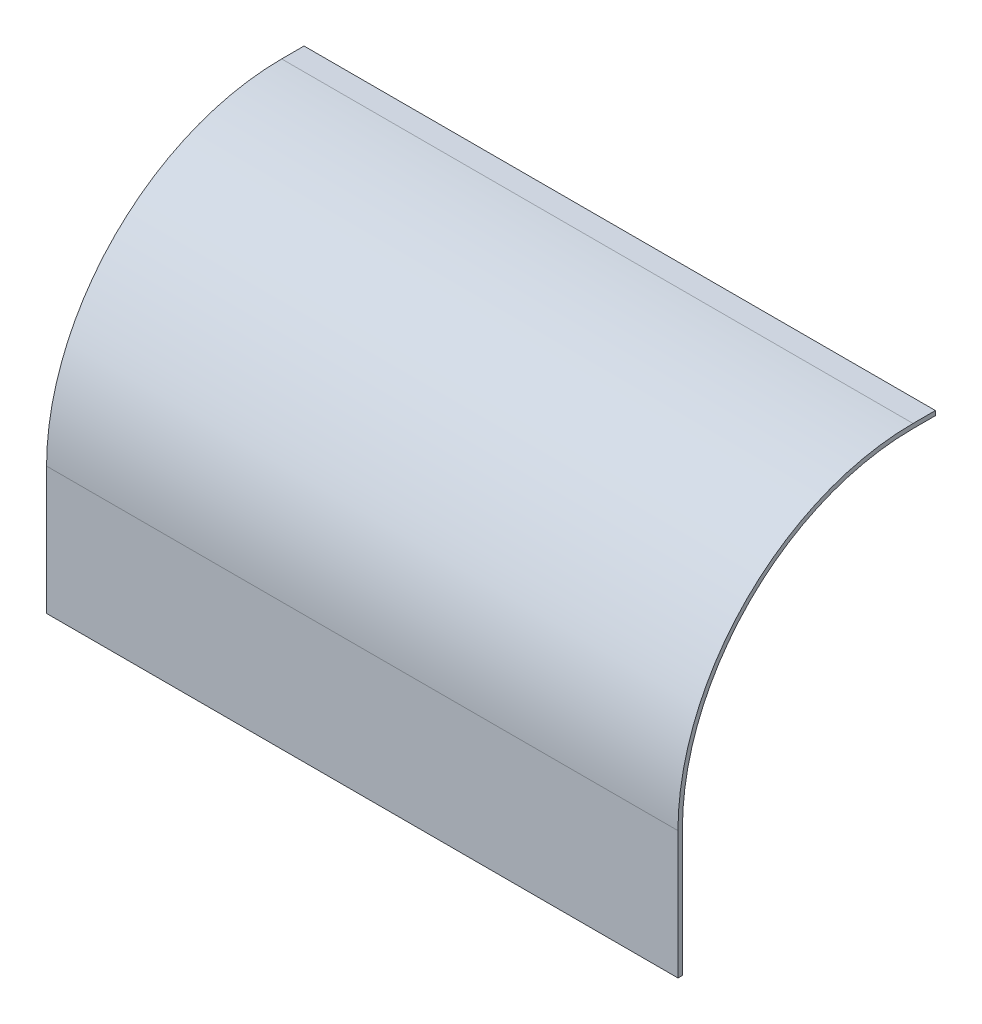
ISO-10303-21;
HEADER;
FILE_DESCRIPTION(('STEP AP214'),'2;1');
FILE_NAME('part.step','',(''),(''),'','','');
FILE_SCHEMA(('AUTOMOTIVE_DESIGN { 1 0 10303 214 1 1 1 1 }'));
ENDSEC;
DATA;
#1=APPLICATION_CONTEXT('core data for automotive mechanical design processes');
#2=APPLICATION_PROTOCOL_DEFINITION('international standard','automotive_design',2000,#1);
#3=PRODUCT_CONTEXT('',#1,'mechanical');
#4=PRODUCT('Part','Part','',(#3));
#5=PRODUCT_RELATED_PRODUCT_CATEGORY('part','',(#4));
#6=PRODUCT_DEFINITION_FORMATION('','',#4);
#7=PRODUCT_DEFINITION_CONTEXT('part definition',#1,'design');
#8=PRODUCT_DEFINITION('design','',#6,#7);
#9=PRODUCT_DEFINITION_SHAPE('','',#8);
#10=(LENGTH_UNIT() NAMED_UNIT(*) SI_UNIT(.MILLI.,.METRE.));
#11=(NAMED_UNIT(*) PLANE_ANGLE_UNIT() SI_UNIT($,.RADIAN.));
#12=(NAMED_UNIT(*) SI_UNIT($,.STERADIAN.) SOLID_ANGLE_UNIT());
#13=UNCERTAINTY_MEASURE_WITH_UNIT(LENGTH_MEASURE(1.E-05),#10,'distance_accuracy_value','');
#14=(GEOMETRIC_REPRESENTATION_CONTEXT(3) GLOBAL_UNCERTAINTY_ASSIGNED_CONTEXT((#13)) GLOBAL_UNIT_ASSIGNED_CONTEXT((#10,
#11,#12)) REPRESENTATION_CONTEXT('',''));
#15=CARTESIAN_POINT('',(0.,0.,0.));
#16=DIRECTION('',(0.,0.,1.));
#17=DIRECTION('',(1.,0.,0.));
#18=AXIS2_PLACEMENT_3D('',#15,#16,#17);
#19=CARTESIAN_POINT('',(-438.668064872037,112.,-5.00000000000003));
#20=DIRECTION('',(1.,0.,0.));
#21=DIRECTION('',(0.,0.,-1.));
#22=AXIS2_PLACEMENT_3D('',#19,#20,#21);
#23=CYLINDRICAL_SURFACE('',#22,105.);
#24=DIRECTION('',(1.,0.,0.));
#25=VECTOR('',#24,1.);
#26=CARTESIAN_POINT('',(-438.668064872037,217.,-5.00000000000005));
#27=LINE('',#26,#25);
#28=CARTESIAN_POINT('',(-231.,217.,-5.00000000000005));
#29=VERTEX_POINT('',#28);
#30=CARTESIAN_POINT('',(51.,217.,-5.00000000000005));
#31=VERTEX_POINT('',#30);
#32=EDGE_CURVE('E114',#29,#31,#27,.T.);
#33=ORIENTED_EDGE('',*,*,#32,.F.);
#34=CARTESIAN_POINT('',(-231.,112.,-5.00000000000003));
#35=DIRECTION('',(1.,0.,0.));
#36=DIRECTION('',(0.,0.,-1.));
#37=AXIS2_PLACEMENT_3D('',#34,#35,#36);
#38=CIRCLE('',#37,105.);
#39=CARTESIAN_POINT('',(-231.,112.,100.));
#40=VERTEX_POINT('',#39);
#41=EDGE_CURVE('E37',#29,#40,#38,.T.);
#42=ORIENTED_EDGE('',*,*,#41,.T.);
#43=DIRECTION('',(1.,0.,0.));
#44=VECTOR('',#43,1.);
#45=CARTESIAN_POINT('',(-438.668064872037,112.,100.));
#46=LINE('',#45,#44);
#47=CARTESIAN_POINT('',(51.,112.,100.));
#48=VERTEX_POINT('',#47);
#49=EDGE_CURVE('E148',#40,#48,#46,.T.);
#50=ORIENTED_EDGE('',*,*,#49,.T.);
#51=CARTESIAN_POINT('',(51.,112.,-5.00000000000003));
#52=DIRECTION('',(1.,0.,0.));
#53=DIRECTION('',(0.,0.,-1.));
#54=AXIS2_PLACEMENT_3D('',#51,#52,#53);
#55=CIRCLE('',#54,105.);
#56=EDGE_CURVE('E131',#48,#31,#55,.F.);
#57=ORIENTED_EDGE('',*,*,#56,.T.);
#58=EDGE_LOOP('',(#33,#42,#50,#57));
#59=FACE_BOUND('',#58,.T.);
#60=ADVANCED_FACE('F33',(#59),#23,.T.);
#61=CARTESIAN_POINT('',(-438.668064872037,55.,100.));
#62=DIRECTION('',(0.,0.,-1.));
#63=DIRECTION('',(-1.,0.,0.));
#64=AXIS2_PLACEMENT_3D('',#61,#62,#63);
#65=PLANE('',#64);
#66=ORIENTED_EDGE('',*,*,#49,.F.);
#67=DIRECTION('',(0.,-1.,0.));
#68=VECTOR('',#67,1.);
#69=CARTESIAN_POINT('',(-231.,55.,100.));
#70=LINE('',#69,#68);
#71=CARTESIAN_POINT('',(-231.,55.,100.));
#72=VERTEX_POINT('',#71);
#73=EDGE_CURVE('E136',#40,#72,#70,.T.);
#74=ORIENTED_EDGE('',*,*,#73,.T.);
#75=DIRECTION('',(1.,0.,0.));
#76=VECTOR('',#75,1.);
#77=CARTESIAN_POINT('',(-438.668064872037,55.,100.));
#78=LINE('',#77,#76);
#79=CARTESIAN_POINT('',(51.,55.,100.));
#80=VERTEX_POINT('',#79);
#81=EDGE_CURVE('E150',#72,#80,#78,.T.);
#82=ORIENTED_EDGE('',*,*,#81,.T.);
#83=DIRECTION('',(0.,1.,0.));
#84=VECTOR('',#83,1.);
#85=CARTESIAN_POINT('',(51.,55.,100.));
#86=LINE('',#85,#84);
#87=EDGE_CURVE('E128',#80,#48,#86,.T.);
#88=ORIENTED_EDGE('',*,*,#87,.T.);
#89=EDGE_LOOP('',(#66,#74,#82,#88));
#90=FACE_BOUND('',#89,.T.);
#91=ADVANCED_FACE('F166',(#90),#65,.F.);
#92=CARTESIAN_POINT('',(-438.668064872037,55.,100.));
#93=DIRECTION('',(0.,-1.,0.));
#94=DIRECTION('',(0.,0.,-1.));
#95=AXIS2_PLACEMENT_3D('',#92,#93,#94);
#96=PLANE('',#95);
#97=DIRECTION('',(0.,0.,1.));
#98=VECTOR('',#97,1.);
#99=CARTESIAN_POINT('',(-231.,55.,100.));
#100=LINE('',#99,#98);
#101=CARTESIAN_POINT('',(-231.,55.,98.));
#102=VERTEX_POINT('',#101);
#103=EDGE_CURVE('E139',#102,#72,#100,.T.);
#104=ORIENTED_EDGE('',*,*,#103,.F.);
#105=DIRECTION('',(1.,0.,0.));
#106=VECTOR('',#105,1.);
#107=CARTESIAN_POINT('',(-438.668064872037,55.,98.));
#108=LINE('',#107,#106);
#109=CARTESIAN_POINT('',(51.,55.,98.));
#110=VERTEX_POINT('',#109);
#111=EDGE_CURVE('E152',#102,#110,#108,.T.);
#112=ORIENTED_EDGE('',*,*,#111,.T.);
#113=DIRECTION('',(0.,0.,-1.));
#114=VECTOR('',#113,1.);
#115=CARTESIAN_POINT('',(51.,55.,100.));
#116=LINE('',#115,#114);
#117=EDGE_CURVE('E125',#80,#110,#116,.T.);
#118=ORIENTED_EDGE('',*,*,#117,.F.);
#119=ORIENTED_EDGE('',*,*,#81,.F.);
#120=EDGE_LOOP('',(#104,#112,#118,#119));
#121=FACE_BOUND('',#120,.T.);
#122=ADVANCED_FACE('F170',(#121),#96,.T.);
#123=CARTESIAN_POINT('',(-438.668064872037,55.,98.));
#124=DIRECTION('',(0.,0.,-1.));
#125=DIRECTION('',(-1.,0.,0.));
#126=AXIS2_PLACEMENT_3D('',#123,#124,#125);
#127=PLANE('',#126);
#128=DIRECTION('',(0.,-1.,0.));
#129=VECTOR('',#128,1.);
#130=CARTESIAN_POINT('',(-231.,55.,98.));
#131=LINE('',#130,#129);
#132=CARTESIAN_POINT('',(-231.,112.,98.));
#133=VERTEX_POINT('',#132);
#134=EDGE_CURVE('E141',#133,#102,#131,.T.);
#135=ORIENTED_EDGE('',*,*,#134,.F.);
#136=DIRECTION('',(1.,0.,0.));
#137=VECTOR('',#136,1.);
#138=CARTESIAN_POINT('',(-438.668064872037,112.,98.));
#139=LINE('',#138,#137);
#140=CARTESIAN_POINT('',(51.,112.,98.));
#141=VERTEX_POINT('',#140);
#142=EDGE_CURVE('E154',#133,#141,#139,.T.);
#143=ORIENTED_EDGE('',*,*,#142,.T.);
#144=DIRECTION('',(0.,1.,0.));
#145=VECTOR('',#144,1.);
#146=CARTESIAN_POINT('',(51.,55.,98.));
#147=LINE('',#146,#145);
#148=EDGE_CURVE('E121',#110,#141,#147,.T.);
#149=ORIENTED_EDGE('',*,*,#148,.F.);
#150=ORIENTED_EDGE('',*,*,#111,.F.);
#151=EDGE_LOOP('',(#135,#143,#149,#150));
#152=FACE_BOUND('',#151,.T.);
#153=ADVANCED_FACE('F175',(#152),#127,.T.);
#154=CARTESIAN_POINT('',(-438.668064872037,112.,-5.00000000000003));
#155=DIRECTION('',(1.,0.,0.));
#156=DIRECTION('',(0.,0.,-1.));
#157=AXIS2_PLACEMENT_3D('',#154,#155,#156);
#158=CYLINDRICAL_SURFACE('',#157,103.);
#159=CARTESIAN_POINT('',(-231.,112.,-5.00000000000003));
#160=DIRECTION('',(1.,0.,0.));
#161=DIRECTION('',(0.,0.,-1.));
#162=AXIS2_PLACEMENT_3D('',#159,#160,#161);
#163=CIRCLE('',#162,103.);
#164=CARTESIAN_POINT('',(-231.,215.,-5.00000000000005));
#165=VERTEX_POINT('',#164);
#166=EDGE_CURVE('E143',#165,#133,#163,.T.);
#167=ORIENTED_EDGE('',*,*,#166,.F.);
#168=DIRECTION('',(1.,0.,0.));
#169=VECTOR('',#168,1.);
#170=CARTESIAN_POINT('',(-438.668064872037,215.,-5.00000000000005));
#171=LINE('',#170,#169);
#172=CARTESIAN_POINT('',(51.,215.,-5.00000000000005));
#173=VERTEX_POINT('',#172);
#174=EDGE_CURVE('E105',#165,#173,#171,.T.);
#175=ORIENTED_EDGE('',*,*,#174,.T.);
#176=CARTESIAN_POINT('',(51.,112.,-5.00000000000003));
#177=DIRECTION('',(1.,0.,0.));
#178=DIRECTION('',(0.,0.,-1.));
#179=AXIS2_PLACEMENT_3D('',#176,#177,#178);
#180=CIRCLE('',#179,103.);
#181=EDGE_CURVE('E119',#141,#173,#180,.F.);
#182=ORIENTED_EDGE('',*,*,#181,.F.);
#183=ORIENTED_EDGE('',*,*,#142,.F.);
#184=EDGE_LOOP('',(#167,#175,#182,#183));
#185=FACE_BOUND('',#184,.T.);
#186=ADVANCED_FACE('F179',(#185),#158,.F.);
#187=CARTESIAN_POINT('',(-438.668064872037,215.,-5.00000000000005));
#188=DIRECTION('',(0.,-1.,0.));
#189=DIRECTION('',(0.,0.,-1.));
#190=AXIS2_PLACEMENT_3D('',#187,#188,#189);
#191=PLANE('',#190);
#192=DIRECTION('',(0.,0.,1.));
#193=VECTOR('',#192,1.);
#194=CARTESIAN_POINT('',(-231.,215.,-5.00000000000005));
#195=LINE('',#194,#193);
#196=CARTESIAN_POINT('',(-231.,215.,-15.));
#197=VERTEX_POINT('',#196);
#198=EDGE_CURVE('E54',#197,#165,#195,.T.);
#199=ORIENTED_EDGE('',*,*,#198,.F.);
#200=DIRECTION('',(1.,0.,0.));
#201=VECTOR('',#200,1.);
#202=CARTESIAN_POINT('',(-438.668064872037,215.,-15.));
#203=LINE('',#202,#201);
#204=CARTESIAN_POINT('',(51.,215.,-15.));
#205=VERTEX_POINT('',#204);
#206=EDGE_CURVE('E97',#197,#205,#203,.T.);
#207=ORIENTED_EDGE('',*,*,#206,.T.);
#208=DIRECTION('',(0.,0.,-1.));
#209=VECTOR('',#208,1.);
#210=CARTESIAN_POINT('',(51.,215.,-5.00000000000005));
#211=LINE('',#210,#209);
#212=EDGE_CURVE('E101',#173,#205,#211,.T.);
#213=ORIENTED_EDGE('',*,*,#212,.F.);
#214=ORIENTED_EDGE('',*,*,#174,.F.);
#215=EDGE_LOOP('',(#199,#207,#213,#214));
#216=FACE_BOUND('',#215,.T.);
#217=ADVANCED_FACE('F99',(#216),#191,.T.);
#218=CARTESIAN_POINT('',(-438.668064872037,215.,-15.));
#219=DIRECTION('',(0.,0.,-1.));
#220=DIRECTION('',(-1.,0.,0.));
#221=AXIS2_PLACEMENT_3D('',#218,#219,#220);
#222=PLANE('',#221);
#223=DIRECTION('',(0.,-1.,0.));
#224=VECTOR('',#223,1.);
#225=CARTESIAN_POINT('',(-231.,215.,-15.));
#226=LINE('',#225,#224);
#227=CARTESIAN_POINT('',(-231.,217.,-15.));
#228=VERTEX_POINT('',#227);
#229=EDGE_CURVE('E42',#228,#197,#226,.T.);
#230=ORIENTED_EDGE('',*,*,#229,.F.);
#231=DIRECTION('',(1.,0.,0.));
#232=VECTOR('',#231,1.);
#233=CARTESIAN_POINT('',(-438.668064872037,217.,-15.));
#234=LINE('',#233,#232);
#235=CARTESIAN_POINT('',(51.,217.,-15.));
#236=VERTEX_POINT('',#235);
#237=EDGE_CURVE('E104',#228,#236,#234,.T.);
#238=ORIENTED_EDGE('',*,*,#237,.T.);
#239=DIRECTION('',(0.,1.,0.));
#240=VECTOR('',#239,1.);
#241=CARTESIAN_POINT('',(51.,215.,-15.));
#242=LINE('',#241,#240);
#243=EDGE_CURVE('E108',#205,#236,#242,.T.);
#244=ORIENTED_EDGE('',*,*,#243,.F.);
#245=ORIENTED_EDGE('',*,*,#206,.F.);
#246=EDGE_LOOP('',(#230,#238,#244,#245));
#247=FACE_BOUND('',#246,.T.);
#248=ADVANCED_FACE('F109',(#247),#222,.T.);
#249=CARTESIAN_POINT('',(-438.668064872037,217.,-5.00000000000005));
#250=DIRECTION('',(0.,-1.,0.));
#251=DIRECTION('',(0.,0.,-1.));
#252=AXIS2_PLACEMENT_3D('',#249,#250,#251);
#253=PLANE('',#252);
#254=ORIENTED_EDGE('',*,*,#237,.F.);
#255=DIRECTION('',(0.,0.,1.));
#256=VECTOR('',#255,1.);
#257=CARTESIAN_POINT('',(-231.,217.,-5.00000000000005));
#258=LINE('',#257,#256);
#259=EDGE_CURVE('E11',#228,#29,#258,.T.);
#260=ORIENTED_EDGE('',*,*,#259,.T.);
#261=ORIENTED_EDGE('',*,*,#32,.T.);
#262=DIRECTION('',(0.,0.,-1.));
#263=VECTOR('',#262,1.);
#264=CARTESIAN_POINT('',(51.,217.,-5.00000000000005));
#265=LINE('',#264,#263);
#266=EDGE_CURVE('E134',#31,#236,#265,.T.);
#267=ORIENTED_EDGE('',*,*,#266,.T.);
#268=EDGE_LOOP('',(#254,#260,#261,#267));
#269=FACE_BOUND('',#268,.T.);
#270=ADVANCED_FACE('F35',(#269),#253,.F.);
#271=CARTESIAN_POINT('',(-231.,0.,0.));
#272=DIRECTION('',(1.,0.,0.));
#273=DIRECTION('',(0.,0.,-1.));
#274=AXIS2_PLACEMENT_3D('',#271,#272,#273);
#275=PLANE('',#274);
#276=ORIENTED_EDGE('',*,*,#229,.T.);
#277=ORIENTED_EDGE('',*,*,#198,.T.);
#278=ORIENTED_EDGE('',*,*,#166,.T.);
#279=ORIENTED_EDGE('',*,*,#134,.T.);
#280=ORIENTED_EDGE('',*,*,#103,.T.);
#281=ORIENTED_EDGE('',*,*,#73,.F.);
#282=ORIENTED_EDGE('',*,*,#41,.F.);
#283=ORIENTED_EDGE('',*,*,#259,.F.);
#284=EDGE_LOOP('',(#276,#277,#278,#279,#280,#281,#282,#283));
#285=FACE_BOUND('',#284,.T.);
#286=ADVANCED_FACE('F160',(#285),#275,.F.);
#287=CARTESIAN_POINT('',(51.,265.,-90.));
#288=DIRECTION('',(1.,0.,0.));
#289=DIRECTION('',(0.,0.,-1.));
#290=AXIS2_PLACEMENT_3D('',#287,#288,#289);
#291=PLANE('',#290);
#292=ORIENTED_EDGE('',*,*,#266,.F.);
#293=ORIENTED_EDGE('',*,*,#56,.F.);
#294=ORIENTED_EDGE('',*,*,#87,.F.);
#295=ORIENTED_EDGE('',*,*,#117,.T.);
#296=ORIENTED_EDGE('',*,*,#148,.T.);
#297=ORIENTED_EDGE('',*,*,#181,.T.);
#298=ORIENTED_EDGE('',*,*,#212,.T.);
#299=ORIENTED_EDGE('',*,*,#243,.T.);
#300=EDGE_LOOP('',(#292,#293,#294,#295,#296,#297,#298,#299));
#301=FACE_BOUND('',#300,.T.);
#302=ADVANCED_FACE('F116',(#301),#291,.T.);
#303=CLOSED_SHELL('',(#60,#91,#122,#153,#186,#217,#248,#270,#286,#302));
#304=MANIFOLD_SOLID_BREP('B2',#303);
#305=ADVANCED_BREP_SHAPE_REPRESENTATION('',(#18,#304),#14);
#306=SHAPE_DEFINITION_REPRESENTATION(#9,#305);
ENDSEC;
END-ISO-10303-21;
